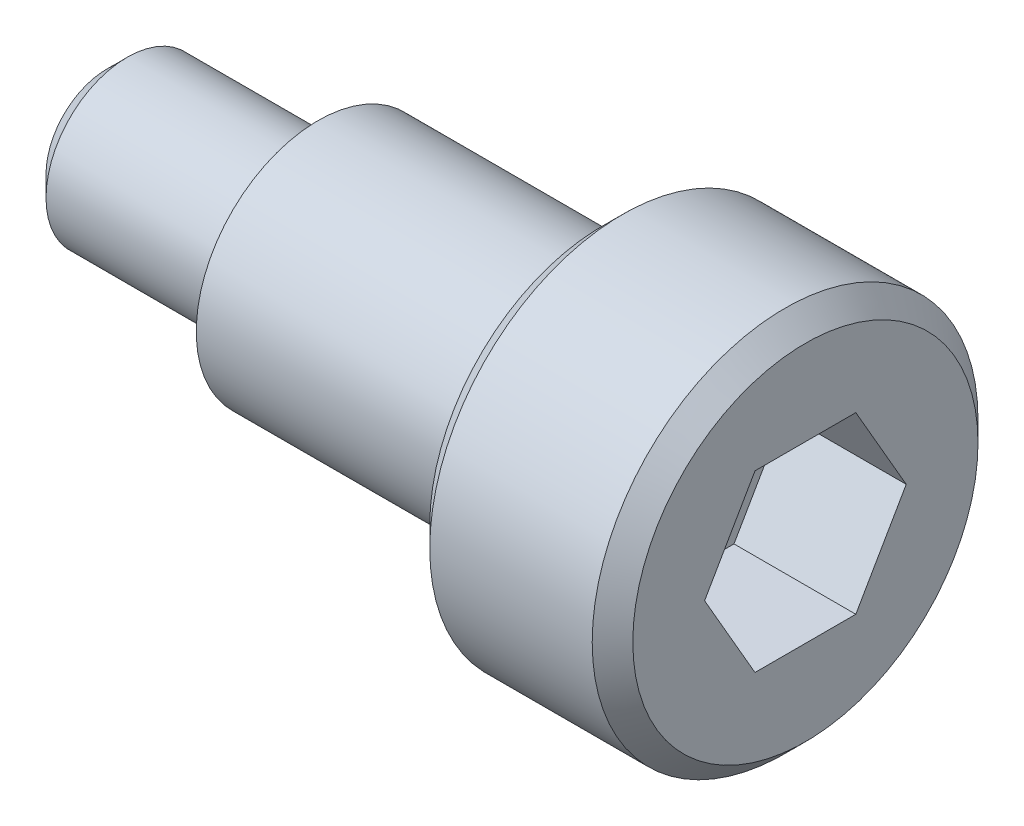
ISO-10303-21;
HEADER;
FILE_DESCRIPTION(('STEP AP214'),'2;1');
FILE_NAME('part.step','',(''),(''),'','','');
FILE_SCHEMA(('AUTOMOTIVE_DESIGN { 1 0 10303 214 1 1 1 1 }'));
ENDSEC;
DATA;
#1=APPLICATION_CONTEXT('core data for automotive mechanical design processes');
#2=APPLICATION_PROTOCOL_DEFINITION('international standard','automotive_design',2000,#1);
#3=PRODUCT_CONTEXT('',#1,'mechanical');
#4=PRODUCT('Part','Part','',(#3));
#5=PRODUCT_RELATED_PRODUCT_CATEGORY('part','',(#4));
#6=PRODUCT_DEFINITION_FORMATION('','',#4);
#7=PRODUCT_DEFINITION_CONTEXT('part definition',#1,'design');
#8=PRODUCT_DEFINITION('design','',#6,#7);
#9=PRODUCT_DEFINITION_SHAPE('','',#8);
#10=(LENGTH_UNIT() NAMED_UNIT(*) SI_UNIT(.MILLI.,.METRE.));
#11=(NAMED_UNIT(*) PLANE_ANGLE_UNIT() SI_UNIT($,.RADIAN.));
#12=(NAMED_UNIT(*) SI_UNIT($,.STERADIAN.) SOLID_ANGLE_UNIT());
#13=UNCERTAINTY_MEASURE_WITH_UNIT(LENGTH_MEASURE(1.E-05),#10,'distance_accuracy_value','');
#14=(GEOMETRIC_REPRESENTATION_CONTEXT(3) GLOBAL_UNCERTAINTY_ASSIGNED_CONTEXT((#13)) GLOBAL_UNIT_ASSIGNED_CONTEXT((#10,
#11,#12)) REPRESENTATION_CONTEXT('',''));
#15=CARTESIAN_POINT('',(0.,0.,0.));
#16=DIRECTION('',(0.,0.,1.));
#17=DIRECTION('',(1.,0.,0.));
#18=AXIS2_PLACEMENT_3D('',#15,#16,#17);
#19=CARTESIAN_POINT('',(0.,0.,0.));
#20=DIRECTION('',(1.,0.,0.));
#21=DIRECTION('',(0.,0.,-1.));
#22=AXIS2_PLACEMENT_3D('',#19,#20,#21);
#23=PLANE('',#22);
#24=DIRECTION('',(0.,0.866025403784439,-0.5));
#25=VECTOR('',#24,1.);
#26=CARTESIAN_POINT('',(0.,-2.15,-1.2413030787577));
#27=LINE('',#26,#25);
#28=CARTESIAN_POINT('',(0.,-2.15,-1.2413030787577));
#29=VERTEX_POINT('',#28);
#30=CARTESIAN_POINT('',(0.,0.,-2.48260615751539));
#31=VERTEX_POINT('',#30);
#32=EDGE_CURVE('E53',#29,#31,#27,.T.);
#33=ORIENTED_EDGE('',*,*,#32,.F.);
#34=DIRECTION('',(0.,0.,-1.));
#35=VECTOR('',#34,1.);
#36=CARTESIAN_POINT('',(0.,-2.15,1.2413030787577));
#37=LINE('',#36,#35);
#38=CARTESIAN_POINT('',(0.,-2.15,1.2413030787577));
#39=VERTEX_POINT('',#38);
#40=EDGE_CURVE('E136',#39,#29,#37,.T.);
#41=ORIENTED_EDGE('',*,*,#40,.F.);
#42=DIRECTION('',(0.,-0.866025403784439,-0.5));
#43=VECTOR('',#42,1.);
#44=CARTESIAN_POINT('',(0.,0.,2.48260615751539));
#45=LINE('',#44,#43);
#46=CARTESIAN_POINT('',(0.,0.,2.48260615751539));
#47=VERTEX_POINT('',#46);
#48=EDGE_CURVE('E134',#47,#39,#45,.T.);
#49=ORIENTED_EDGE('',*,*,#48,.F.);
#50=DIRECTION('',(0.,-0.866025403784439,0.5));
#51=VECTOR('',#50,1.);
#52=CARTESIAN_POINT('',(0.,2.15,1.2413030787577));
#53=LINE('',#52,#51);
#54=CARTESIAN_POINT('',(0.,2.15,1.2413030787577));
#55=VERTEX_POINT('',#54);
#56=EDGE_CURVE('E101',#55,#47,#53,.T.);
#57=ORIENTED_EDGE('',*,*,#56,.F.);
#58=DIRECTION('',(0.,0.,1.));
#59=VECTOR('',#58,1.);
#60=CARTESIAN_POINT('',(0.,2.15,-1.2413030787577));
#61=LINE('',#60,#59);
#62=CARTESIAN_POINT('',(0.,2.15,-1.2413030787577));
#63=VERTEX_POINT('',#62);
#64=EDGE_CURVE('E130',#63,#55,#61,.T.);
#65=ORIENTED_EDGE('',*,*,#64,.F.);
#66=DIRECTION('',(0.,0.866025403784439,0.5));
#67=VECTOR('',#66,1.);
#68=CARTESIAN_POINT('',(0.,0.,-2.48260615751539));
#69=LINE('',#68,#67);
#70=EDGE_CURVE('E127',#31,#63,#69,.T.);
#71=ORIENTED_EDGE('',*,*,#70,.F.);
#72=EDGE_LOOP('',(#33,#41,#49,#57,#65,#71));
#73=FACE_BOUND('',#72,.T.);
#74=CARTESIAN_POINT('',(0.,0.,0.));
#75=DIRECTION('',(1.,0.,0.));
#76=DIRECTION('',(0.,0.,-1.));
#77=AXIS2_PLACEMENT_3D('',#74,#75,#76);
#78=CIRCLE('',#77,4.25);
#79=CARTESIAN_POINT('',(0.,0.,-4.25));
#80=VERTEX_POINT('',#79);
#81=EDGE_CURVE('E160',#80,#80,#78,.T.);
#82=ORIENTED_EDGE('',*,*,#81,.T.);
#83=EDGE_LOOP('',(#82));
#84=FACE_BOUND('',#83,.T.);
#85=ADVANCED_FACE('F38',(#73,#84),#23,.T.);
#86=CARTESIAN_POINT('',(0.,0.,0.));
#87=DIRECTION('',(1.,0.,0.));
#88=DIRECTION('',(0.,0.,-1.));
#89=AXIS2_PLACEMENT_3D('',#86,#87,#88);
#90=CYLINDRICAL_SURFACE('',#89,4.75);
#91=CARTESIAN_POINT('',(-4.5,0.,0.));
#92=DIRECTION('',(-1.,0.,0.));
#93=DIRECTION('',(0.,0.,1.));
#94=AXIS2_PLACEMENT_3D('',#91,#92,#93);
#95=CIRCLE('',#94,4.75);
#96=CARTESIAN_POINT('',(-4.5,0.,4.75));
#97=VERTEX_POINT('',#96);
#98=EDGE_CURVE('E154',#97,#97,#95,.F.);
#99=ORIENTED_EDGE('',*,*,#98,.T.);
#100=EDGE_LOOP('',(#99));
#101=FACE_BOUND('',#100,.T.);
#102=CARTESIAN_POINT('',(-0.500000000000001,0.,0.));
#103=DIRECTION('',(1.,0.,0.));
#104=DIRECTION('',(0.,0.,-1.));
#105=AXIS2_PLACEMENT_3D('',#102,#103,#104);
#106=CIRCLE('',#105,4.75);
#107=CARTESIAN_POINT('',(-0.500000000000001,0.,-4.75));
#108=VERTEX_POINT('',#107);
#109=EDGE_CURVE('E151',#108,#108,#106,.F.);
#110=ORIENTED_EDGE('',*,*,#109,.T.);
#111=EDGE_LOOP('',(#110));
#112=FACE_BOUND('',#111,.T.);
#113=ADVANCED_FACE('F188',(#101,#112),#90,.T.);
#114=CARTESIAN_POINT('',(-5.,4.75,0.));
#115=DIRECTION('',(-1.,0.,0.));
#116=DIRECTION('',(0.,0.,1.));
#117=AXIS2_PLACEMENT_3D('',#114,#115,#116);
#118=PLANE('',#117);
#119=CARTESIAN_POINT('',(-5.,0.,0.));
#120=DIRECTION('',(-1.,0.,0.));
#121=DIRECTION('',(0.,0.,1.));
#122=AXIS2_PLACEMENT_3D('',#119,#120,#121);
#123=CIRCLE('',#122,3.5);
#124=CARTESIAN_POINT('',(-5.,0.,3.5));
#125=VERTEX_POINT('',#124);
#126=EDGE_CURVE('E46',#125,#125,#123,.F.);
#127=ORIENTED_EDGE('',*,*,#126,.T.);
#128=EDGE_LOOP('',(#127));
#129=FACE_BOUND('',#128,.T.);
#130=CARTESIAN_POINT('',(-5.,0.,0.));
#131=DIRECTION('',(-1.,0.,0.));
#132=DIRECTION('',(0.,0.,1.));
#133=AXIS2_PLACEMENT_3D('',#130,#131,#132);
#134=CIRCLE('',#133,4.24999999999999);
#135=CARTESIAN_POINT('',(-5.,0.,4.24999999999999));
#136=VERTEX_POINT('',#135);
#137=EDGE_CURVE('E157',#136,#136,#134,.T.);
#138=ORIENTED_EDGE('',*,*,#137,.T.);
#139=EDGE_LOOP('',(#138));
#140=FACE_BOUND('',#139,.T.);
#141=ADVANCED_FACE('F171',(#129,#140),#118,.T.);
#142=CARTESIAN_POINT('',(0.,0.,0.));
#143=DIRECTION('',(1.,0.,0.));
#144=DIRECTION('',(0.,0.,-1.));
#145=AXIS2_PLACEMENT_3D('',#142,#143,#144);
#146=CYLINDRICAL_SURFACE('',#145,3.);
#147=CARTESIAN_POINT('',(-5.5,0.,0.));
#148=DIRECTION('',(-1.,0.,0.));
#149=DIRECTION('',(0.,0.,1.));
#150=AXIS2_PLACEMENT_3D('',#147,#148,#149);
#151=CIRCLE('',#150,3.);
#152=CARTESIAN_POINT('',(-5.5,0.,3.));
#153=VERTEX_POINT('',#152);
#154=EDGE_CURVE('E11',#153,#153,#151,.T.);
#155=ORIENTED_EDGE('',*,*,#154,.T.);
#156=EDGE_LOOP('',(#155));
#157=FACE_BOUND('',#156,.T.);
#158=CARTESIAN_POINT('',(-12.,0.,0.));
#159=DIRECTION('',(1.,0.,0.));
#160=DIRECTION('',(0.,0.,-1.));
#161=AXIS2_PLACEMENT_3D('',#158,#159,#160);
#162=CIRCLE('',#161,3.);
#163=CARTESIAN_POINT('',(-12.,0.,-3.));
#164=VERTEX_POINT('',#163);
#165=EDGE_CURVE('E148',#164,#164,#162,.T.);
#166=ORIENTED_EDGE('',*,*,#165,.T.);
#167=EDGE_LOOP('',(#166));
#168=FACE_BOUND('',#167,.T.);
#169=ADVANCED_FACE('F229',(#157,#168),#146,.T.);
#170=CARTESIAN_POINT('',(-12.,3.,0.));
#171=DIRECTION('',(-1.,0.,0.));
#172=DIRECTION('',(0.,0.,1.));
#173=AXIS2_PLACEMENT_3D('',#170,#171,#172);
#174=PLANE('',#173);
#175=CARTESIAN_POINT('',(-12.,0.,0.));
#176=DIRECTION('',(1.,0.,0.));
#177=DIRECTION('',(0.,0.,-1.));
#178=AXIS2_PLACEMENT_3D('',#175,#176,#177);
#179=CIRCLE('',#178,2.);
#180=CARTESIAN_POINT('',(-12.,0.,-2.));
#181=VERTEX_POINT('',#180);
#182=EDGE_CURVE('E140',#181,#181,#179,.T.);
#183=ORIENTED_EDGE('',*,*,#182,.T.);
#184=EDGE_LOOP('',(#183));
#185=FACE_BOUND('',#184,.T.);
#186=ORIENTED_EDGE('',*,*,#165,.F.);
#187=EDGE_LOOP('',(#186));
#188=FACE_BOUND('',#187,.T.);
#189=ADVANCED_FACE('F237',(#185,#188),#174,.T.);
#190=CARTESIAN_POINT('',(0.,0.,0.));
#191=DIRECTION('',(1.,0.,0.));
#192=DIRECTION('',(0.,0.,-1.));
#193=AXIS2_PLACEMENT_3D('',#190,#191,#192);
#194=CYLINDRICAL_SURFACE('',#193,2.);
#195=CARTESIAN_POINT('',(-16.7,0.,0.));
#196=DIRECTION('',(-1.,0.,0.));
#197=DIRECTION('',(0.,0.,1.));
#198=AXIS2_PLACEMENT_3D('',#195,#196,#197);
#199=CIRCLE('',#198,2.);
#200=CARTESIAN_POINT('',(-16.7,0.,2.));
#201=VERTEX_POINT('',#200);
#202=EDGE_CURVE('E163',#201,#201,#199,.F.);
#203=ORIENTED_EDGE('',*,*,#202,.T.);
#204=EDGE_LOOP('',(#203));
#205=FACE_BOUND('',#204,.T.);
#206=ORIENTED_EDGE('',*,*,#182,.F.);
#207=EDGE_LOOP('',(#206));
#208=FACE_BOUND('',#207,.T.);
#209=ADVANCED_FACE('F312',(#205,#208),#194,.T.);
#210=CARTESIAN_POINT('',(-17.2,2.,0.));
#211=DIRECTION('',(-1.,0.,0.));
#212=DIRECTION('',(0.,0.,1.));
#213=AXIS2_PLACEMENT_3D('',#210,#211,#212);
#214=PLANE('',#213);
#215=CARTESIAN_POINT('',(-17.2,0.,0.));
#216=DIRECTION('',(-1.,0.,0.));
#217=DIRECTION('',(0.,0.,1.));
#218=AXIS2_PLACEMENT_3D('',#215,#216,#217);
#219=CIRCLE('',#218,1.49999999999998);
#220=CARTESIAN_POINT('',(-17.2,0.,1.49999999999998));
#221=VERTEX_POINT('',#220);
#222=EDGE_CURVE('E166',#221,#221,#219,.T.);
#223=ORIENTED_EDGE('',*,*,#222,.T.);
#224=EDGE_LOOP('',(#223));
#225=FACE_BOUND('',#224,.T.);
#226=ADVANCED_FACE('F202',(#225),#214,.T.);
#227=CARTESIAN_POINT('',(-4.5,0.,0.));
#228=DIRECTION('',(1.,0.,0.));
#229=DIRECTION('',(0.,0.,-1.));
#230=AXIS2_PLACEMENT_3D('',#227,#228,#229);
#231=CONICAL_SURFACE('',#230,4.75,0.785398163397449);
#232=ORIENTED_EDGE('',*,*,#137,.F.);
#233=EDGE_LOOP('',(#232));
#234=FACE_BOUND('',#233,.T.);
#235=ORIENTED_EDGE('',*,*,#98,.F.);
#236=EDGE_LOOP('',(#235));
#237=FACE_BOUND('',#236,.T.);
#238=ADVANCED_FACE('F199',(#234,#237),#231,.T.);
#239=CARTESIAN_POINT('',(0.,0.,0.));
#240=DIRECTION('',(-1.,0.,0.));
#241=DIRECTION('',(0.,0.,1.));
#242=AXIS2_PLACEMENT_3D('',#239,#240,#241);
#243=CONICAL_SURFACE('',#242,4.25,0.785398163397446);
#244=ORIENTED_EDGE('',*,*,#109,.F.);
#245=EDGE_LOOP('',(#244));
#246=FACE_BOUND('',#245,.T.);
#247=ORIENTED_EDGE('',*,*,#81,.F.);
#248=EDGE_LOOP('',(#247));
#249=FACE_BOUND('',#248,.T.);
#250=ADVANCED_FACE('F184',(#246,#249),#243,.T.);
#251=CARTESIAN_POINT('',(-16.7,0.,0.));
#252=DIRECTION('',(1.,0.,0.));
#253=DIRECTION('',(0.,0.,-1.));
#254=AXIS2_PLACEMENT_3D('',#251,#252,#253);
#255=CONICAL_SURFACE('',#254,2.,0.785398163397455);
#256=ORIENTED_EDGE('',*,*,#222,.F.);
#257=EDGE_LOOP('',(#256));
#258=FACE_BOUND('',#257,.T.);
#259=ORIENTED_EDGE('',*,*,#202,.F.);
#260=EDGE_LOOP('',(#259));
#261=FACE_BOUND('',#260,.T.);
#262=ADVANCED_FACE('F176',(#258,#261),#255,.T.);
#263=CARTESIAN_POINT('',(-5.5,0.,0.));
#264=DIRECTION('',(-1.,0.,0.));
#265=DIRECTION('',(0.,0.,1.));
#266=AXIS2_PLACEMENT_3D('',#263,#264,#265);
#267=TOROIDAL_SURFACE('',#266,3.5,0.5);
#268=ORIENTED_EDGE('',*,*,#154,.F.);
#269=EDGE_LOOP('',(#268));
#270=FACE_BOUND('',#269,.T.);
#271=ORIENTED_EDGE('',*,*,#126,.F.);
#272=EDGE_LOOP('',(#271));
#273=FACE_BOUND('',#272,.T.);
#274=ADVANCED_FACE('F40',(#270,#273),#267,.F.);
#275=CARTESIAN_POINT('',(-3.,-2.15,-1.2413030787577));
#276=DIRECTION('',(0.,-0.5,-0.866025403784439));
#277=DIRECTION('',(0.,0.866025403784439,-0.5));
#278=AXIS2_PLACEMENT_3D('',#275,#276,#277);
#279=PLANE('',#278);
#280=ORIENTED_EDGE('',*,*,#32,.T.);
#281=DIRECTION('',(1.,0.,0.));
#282=VECTOR('',#281,1.);
#283=CARTESIAN_POINT('',(-3.,0.,-2.48260615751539));
#284=LINE('',#283,#282);
#285=CARTESIAN_POINT('',(-3.,0.,-2.48260615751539));
#286=VERTEX_POINT('',#285);
#287=EDGE_CURVE('E83',#286,#31,#284,.T.);
#288=ORIENTED_EDGE('',*,*,#287,.F.);
#289=DIRECTION('',(0.,0.866025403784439,-0.5));
#290=VECTOR('',#289,1.);
#291=CARTESIAN_POINT('',(-3.,-2.15,-1.2413030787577));
#292=LINE('',#291,#290);
#293=CARTESIAN_POINT('',(-3.,-2.15,-1.2413030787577));
#294=VERTEX_POINT('',#293);
#295=EDGE_CURVE('E138',#294,#286,#292,.T.);
#296=ORIENTED_EDGE('',*,*,#295,.F.);
#297=DIRECTION('',(1.,0.,0.));
#298=VECTOR('',#297,1.);
#299=CARTESIAN_POINT('',(-3.,-2.15,-1.2413030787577));
#300=LINE('',#299,#298);
#301=EDGE_CURVE('E61',#294,#29,#300,.T.);
#302=ORIENTED_EDGE('',*,*,#301,.T.);
#303=EDGE_LOOP('',(#280,#288,#296,#302));
#304=FACE_BOUND('',#303,.T.);
#305=ADVANCED_FACE('F175',(#304),#279,.F.);
#306=CARTESIAN_POINT('',(-3.,-2.15,1.2413030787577));
#307=DIRECTION('',(0.,-1.,0.));
#308=DIRECTION('',(0.,0.,-1.));
#309=AXIS2_PLACEMENT_3D('',#306,#307,#308);
#310=PLANE('',#309);
#311=ORIENTED_EDGE('',*,*,#40,.T.);
#312=ORIENTED_EDGE('',*,*,#301,.F.);
#313=DIRECTION('',(0.,0.,-1.));
#314=VECTOR('',#313,1.);
#315=CARTESIAN_POINT('',(-3.,-2.15,1.2413030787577));
#316=LINE('',#315,#314);
#317=CARTESIAN_POINT('',(-3.,-2.15,1.2413030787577));
#318=VERTEX_POINT('',#317);
#319=EDGE_CURVE('E113',#318,#294,#316,.T.);
#320=ORIENTED_EDGE('',*,*,#319,.F.);
#321=DIRECTION('',(1.,0.,0.));
#322=VECTOR('',#321,1.);
#323=CARTESIAN_POINT('',(-3.,-2.15,1.2413030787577));
#324=LINE('',#323,#322);
#325=EDGE_CURVE('E105',#318,#39,#324,.T.);
#326=ORIENTED_EDGE('',*,*,#325,.T.);
#327=EDGE_LOOP('',(#311,#312,#320,#326));
#328=FACE_BOUND('',#327,.T.);
#329=ADVANCED_FACE('F182',(#328),#310,.F.);
#330=CARTESIAN_POINT('',(-3.,0.,2.48260615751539));
#331=DIRECTION('',(0.,-0.5,0.866025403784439));
#332=DIRECTION('',(0.,-0.866025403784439,-0.5));
#333=AXIS2_PLACEMENT_3D('',#330,#331,#332);
#334=PLANE('',#333);
#335=ORIENTED_EDGE('',*,*,#48,.T.);
#336=ORIENTED_EDGE('',*,*,#325,.F.);
#337=DIRECTION('',(0.,-0.866025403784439,-0.5));
#338=VECTOR('',#337,1.);
#339=CARTESIAN_POINT('',(-3.,0.,2.48260615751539));
#340=LINE('',#339,#338);
#341=CARTESIAN_POINT('',(-3.,0.,2.48260615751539));
#342=VERTEX_POINT('',#341);
#343=EDGE_CURVE('E109',#342,#318,#340,.T.);
#344=ORIENTED_EDGE('',*,*,#343,.F.);
#345=DIRECTION('',(1.,0.,0.));
#346=VECTOR('',#345,1.);
#347=CARTESIAN_POINT('',(-3.,0.,2.48260615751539));
#348=LINE('',#347,#346);
#349=EDGE_CURVE('E94',#342,#47,#348,.T.);
#350=ORIENTED_EDGE('',*,*,#349,.T.);
#351=EDGE_LOOP('',(#335,#336,#344,#350));
#352=FACE_BOUND('',#351,.T.);
#353=ADVANCED_FACE('F110',(#352),#334,.F.);
#354=CARTESIAN_POINT('',(-3.,2.15,1.2413030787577));
#355=DIRECTION('',(0.,0.5,0.866025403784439));
#356=DIRECTION('',(0.,-0.866025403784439,0.5));
#357=AXIS2_PLACEMENT_3D('',#354,#355,#356);
#358=PLANE('',#357);
#359=ORIENTED_EDGE('',*,*,#56,.T.);
#360=ORIENTED_EDGE('',*,*,#349,.F.);
#361=DIRECTION('',(0.,-0.866025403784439,0.5));
#362=VECTOR('',#361,1.);
#363=CARTESIAN_POINT('',(-3.,2.15,1.2413030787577));
#364=LINE('',#363,#362);
#365=CARTESIAN_POINT('',(-3.,2.15,1.2413030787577));
#366=VERTEX_POINT('',#365);
#367=EDGE_CURVE('E98',#366,#342,#364,.T.);
#368=ORIENTED_EDGE('',*,*,#367,.F.);
#369=DIRECTION('',(1.,0.,0.));
#370=VECTOR('',#369,1.);
#371=CARTESIAN_POINT('',(-3.,2.15,1.2413030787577));
#372=LINE('',#371,#370);
#373=EDGE_CURVE('E106',#366,#55,#372,.T.);
#374=ORIENTED_EDGE('',*,*,#373,.T.);
#375=EDGE_LOOP('',(#359,#360,#368,#374));
#376=FACE_BOUND('',#375,.T.);
#377=ADVANCED_FACE('F96',(#376),#358,.F.);
#378=CARTESIAN_POINT('',(-3.,2.15,-1.2413030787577));
#379=DIRECTION('',(0.,1.,0.));
#380=DIRECTION('',(0.,0.,1.));
#381=AXIS2_PLACEMENT_3D('',#378,#379,#380);
#382=PLANE('',#381);
#383=ORIENTED_EDGE('',*,*,#64,.T.);
#384=ORIENTED_EDGE('',*,*,#373,.F.);
#385=DIRECTION('',(0.,0.,1.));
#386=VECTOR('',#385,1.);
#387=CARTESIAN_POINT('',(-3.,2.15,-1.2413030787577));
#388=LINE('',#387,#386);
#389=CARTESIAN_POINT('',(-3.,2.15,-1.2413030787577));
#390=VERTEX_POINT('',#389);
#391=EDGE_CURVE('E119',#390,#366,#388,.T.);
#392=ORIENTED_EDGE('',*,*,#391,.F.);
#393=DIRECTION('',(1.,0.,0.));
#394=VECTOR('',#393,1.);
#395=CARTESIAN_POINT('',(-3.,2.15,-1.2413030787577));
#396=LINE('',#395,#394);
#397=EDGE_CURVE('E143',#390,#63,#396,.T.);
#398=ORIENTED_EDGE('',*,*,#397,.T.);
#399=EDGE_LOOP('',(#383,#384,#392,#398));
#400=FACE_BOUND('',#399,.T.);
#401=ADVANCED_FACE('F279',(#400),#382,.F.);
#402=CARTESIAN_POINT('',(-3.,0.,-2.48260615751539));
#403=DIRECTION('',(0.,0.5,-0.866025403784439));
#404=DIRECTION('',(0.,0.866025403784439,0.5));
#405=AXIS2_PLACEMENT_3D('',#402,#403,#404);
#406=PLANE('',#405);
#407=ORIENTED_EDGE('',*,*,#70,.T.);
#408=ORIENTED_EDGE('',*,*,#397,.F.);
#409=DIRECTION('',(0.,0.866025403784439,0.5));
#410=VECTOR('',#409,1.);
#411=CARTESIAN_POINT('',(-3.,0.,-2.48260615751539));
#412=LINE('',#411,#410);
#413=EDGE_CURVE('E121',#286,#390,#412,.T.);
#414=ORIENTED_EDGE('',*,*,#413,.F.);
#415=ORIENTED_EDGE('',*,*,#287,.T.);
#416=EDGE_LOOP('',(#407,#408,#414,#415));
#417=FACE_BOUND('',#416,.T.);
#418=ADVANCED_FACE('F288',(#417),#406,.F.);
#419=CARTESIAN_POINT('',(-3.,0.,0.));
#420=DIRECTION('',(1.,0.,0.));
#421=DIRECTION('',(0.,0.,-1.));
#422=AXIS2_PLACEMENT_3D('',#419,#420,#421);
#423=PLANE('',#422);
#424=ORIENTED_EDGE('',*,*,#295,.T.);
#425=ORIENTED_EDGE('',*,*,#413,.T.);
#426=ORIENTED_EDGE('',*,*,#391,.T.);
#427=ORIENTED_EDGE('',*,*,#367,.T.);
#428=ORIENTED_EDGE('',*,*,#343,.T.);
#429=ORIENTED_EDGE('',*,*,#319,.T.);
#430=EDGE_LOOP('',(#424,#425,#426,#427,#428,#429));
#431=FACE_BOUND('',#430,.T.);
#432=ADVANCED_FACE('F116',(#431),#423,.T.);
#433=CLOSED_SHELL('',(#85,#113,#141,#169,#189,#209,#226,#238,#250,#262,#274,#305,#329,#353,#377,
#401,#418,#432));
#434=MANIFOLD_SOLID_BREP('B2',#433);
#435=ADVANCED_BREP_SHAPE_REPRESENTATION('',(#18,#434),#14);
#436=SHAPE_DEFINITION_REPRESENTATION(#9,#435);
ENDSEC;
END-ISO-10303-21;
